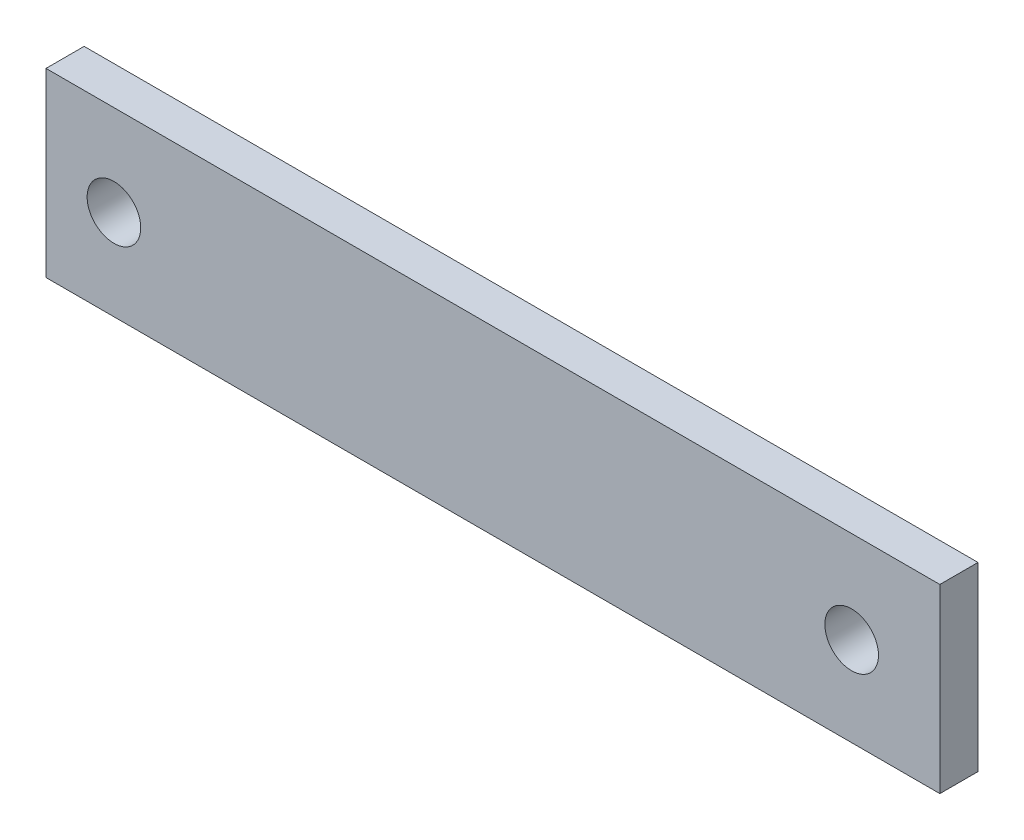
ISO-10303-21;
HEADER;
FILE_DESCRIPTION(('STEP AP214'),'2;1');
FILE_NAME('part.step','',(''),(''),'','','');
FILE_SCHEMA(('AUTOMOTIVE_DESIGN { 1 0 10303 214 1 1 1 1 }'));
ENDSEC;
DATA;
#1=APPLICATION_CONTEXT('core data for automotive mechanical design processes');
#2=APPLICATION_PROTOCOL_DEFINITION('international standard','automotive_design',2000,#1);
#3=PRODUCT_CONTEXT('',#1,'mechanical');
#4=PRODUCT('Part','Part','',(#3));
#5=PRODUCT_RELATED_PRODUCT_CATEGORY('part','',(#4));
#6=PRODUCT_DEFINITION_FORMATION('','',#4);
#7=PRODUCT_DEFINITION_CONTEXT('part definition',#1,'design');
#8=PRODUCT_DEFINITION('design','',#6,#7);
#9=PRODUCT_DEFINITION_SHAPE('','',#8);
#10=(LENGTH_UNIT() NAMED_UNIT(*) SI_UNIT(.MILLI.,.METRE.));
#11=(NAMED_UNIT(*) PLANE_ANGLE_UNIT() SI_UNIT($,.RADIAN.));
#12=(NAMED_UNIT(*) SI_UNIT($,.STERADIAN.) SOLID_ANGLE_UNIT());
#13=UNCERTAINTY_MEASURE_WITH_UNIT(LENGTH_MEASURE(1.E-05),#10,'distance_accuracy_value','');
#14=(GEOMETRIC_REPRESENTATION_CONTEXT(3) GLOBAL_UNCERTAINTY_ASSIGNED_CONTEXT((#13)) GLOBAL_UNIT_ASSIGNED_CONTEXT((#10,
#11,#12)) REPRESENTATION_CONTEXT('',''));
#15=CARTESIAN_POINT('',(0.,0.,0.));
#16=DIRECTION('',(0.,0.,1.));
#17=DIRECTION('',(1.,0.,0.));
#18=AXIS2_PLACEMENT_3D('',#15,#16,#17);
#19=CARTESIAN_POINT('',(-24.3932594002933,11.4859849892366,1.6));
#20=DIRECTION('',(0.,0.,1.));
#21=DIRECTION('',(1.,0.,0.));
#22=AXIS2_PLACEMENT_3D('',#19,#20,#21);
#23=PLANE('',#22);
#24=CARTESIAN_POINT('',(9.40674059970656,15.2245708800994,1.6));
#25=DIRECTION('',(0.,0.,1.));
#26=DIRECTION('',(1.,0.,0.));
#27=AXIS2_PLACEMENT_3D('',#24,#25,#26);
#28=CIRCLE('',#27,1.12491727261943);
#29=CARTESIAN_POINT('',(10.531657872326,15.2245708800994,1.6));
#30=VERTEX_POINT('',#29);
#31=EDGE_CURVE('E85',#30,#30,#28,.T.);
#32=ORIENTED_EDGE('',*,*,#31,.F.);
#33=EDGE_LOOP('',(#32));
#34=FACE_BOUND('',#33,.T.);
#35=DIRECTION('',(0.,-1.,0.));
#36=VECTOR('',#35,1.);
#37=CARTESIAN_POINT('',(-24.3932594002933,19.0859849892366,1.6));
#38=LINE('',#37,#36);
#39=CARTESIAN_POINT('',(-24.3932594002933,19.0859849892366,1.6));
#40=VERTEX_POINT('',#39);
#41=CARTESIAN_POINT('',(-24.3932594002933,11.4859849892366,1.6));
#42=VERTEX_POINT('',#41);
#43=EDGE_CURVE('E95',#40,#42,#38,.T.);
#44=ORIENTED_EDGE('',*,*,#43,.T.);
#45=DIRECTION('',(1.,0.,0.));
#46=VECTOR('',#45,1.);
#47=CARTESIAN_POINT('',(-24.3932594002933,11.4859849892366,1.6));
#48=LINE('',#47,#46);
#49=CARTESIAN_POINT('',(13.1067405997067,11.4859849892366,1.6));
#50=VERTEX_POINT('',#49);
#51=EDGE_CURVE('E80',#42,#50,#48,.T.);
#52=ORIENTED_EDGE('',*,*,#51,.T.);
#53=DIRECTION('',(0.,1.,0.));
#54=VECTOR('',#53,1.);
#55=CARTESIAN_POINT('',(13.1067405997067,19.0859849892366,1.6));
#56=LINE('',#55,#54);
#57=CARTESIAN_POINT('',(13.1067405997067,19.0859849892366,1.6));
#58=VERTEX_POINT('',#57);
#59=EDGE_CURVE('E46',#50,#58,#56,.T.);
#60=ORIENTED_EDGE('',*,*,#59,.T.);
#61=DIRECTION('',(-1.,0.,0.));
#62=VECTOR('',#61,1.);
#63=CARTESIAN_POINT('',(-24.3932594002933,19.0859849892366,1.6));
#64=LINE('',#63,#62);
#65=EDGE_CURVE('E41',#58,#40,#64,.T.);
#66=ORIENTED_EDGE('',*,*,#65,.T.);
#67=EDGE_LOOP('',(#44,#52,#60,#66));
#68=FACE_BOUND('',#67,.T.);
#69=CARTESIAN_POINT('',(-21.5432594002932,15.2792621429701,1.6));
#70=DIRECTION('',(0.,0.,1.));
#71=DIRECTION('',(1.,0.,0.));
#72=AXIS2_PLACEMENT_3D('',#69,#70,#71);
#73=CIRCLE('',#72,1.12491727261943);
#74=CARTESIAN_POINT('',(-20.4183421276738,15.2792621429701,1.6));
#75=VERTEX_POINT('',#74);
#76=EDGE_CURVE('E113',#75,#75,#73,.T.);
#77=ORIENTED_EDGE('',*,*,#76,.F.);
#78=EDGE_LOOP('',(#77));
#79=FACE_BOUND('',#78,.T.);
#80=ADVANCED_FACE('F26',(#34,#68,#79),#23,.T.);
#81=CARTESIAN_POINT('',(-24.3932594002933,11.4859849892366,0.));
#82=DIRECTION('',(0.,0.,1.));
#83=DIRECTION('',(1.,0.,0.));
#84=AXIS2_PLACEMENT_3D('',#81,#82,#83);
#85=PLANE('',#84);
#86=CARTESIAN_POINT('',(9.40674059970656,15.2245708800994,0.));
#87=DIRECTION('',(0.,0.,1.));
#88=DIRECTION('',(1.,0.,0.));
#89=AXIS2_PLACEMENT_3D('',#86,#87,#88);
#90=CIRCLE('',#89,1.12491727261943);
#91=CARTESIAN_POINT('',(10.531657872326,15.2245708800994,0.));
#92=VERTEX_POINT('',#91);
#93=EDGE_CURVE('E88',#92,#92,#90,.T.);
#94=ORIENTED_EDGE('',*,*,#93,.T.);
#95=EDGE_LOOP('',(#94));
#96=FACE_BOUND('',#95,.T.);
#97=DIRECTION('',(0.,-1.,0.));
#98=VECTOR('',#97,1.);
#99=CARTESIAN_POINT('',(-24.3932594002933,19.0859849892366,0.));
#100=LINE('',#99,#98);
#101=CARTESIAN_POINT('',(-24.3932594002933,19.0859849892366,0.));
#102=VERTEX_POINT('',#101);
#103=CARTESIAN_POINT('',(-24.3932594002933,11.4859849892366,0.));
#104=VERTEX_POINT('',#103);
#105=EDGE_CURVE('E72',#102,#104,#100,.T.);
#106=ORIENTED_EDGE('',*,*,#105,.F.);
#107=DIRECTION('',(-1.,0.,0.));
#108=VECTOR('',#107,1.);
#109=CARTESIAN_POINT('',(-24.3932594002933,19.0859849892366,0.));
#110=LINE('',#109,#108);
#111=CARTESIAN_POINT('',(13.1067405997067,19.0859849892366,0.));
#112=VERTEX_POINT('',#111);
#113=EDGE_CURVE('E93',#112,#102,#110,.T.);
#114=ORIENTED_EDGE('',*,*,#113,.F.);
#115=DIRECTION('',(0.,1.,0.));
#116=VECTOR('',#115,1.);
#117=CARTESIAN_POINT('',(13.1067405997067,19.0859849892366,0.));
#118=LINE('',#117,#116);
#119=CARTESIAN_POINT('',(13.1067405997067,11.4859849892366,0.));
#120=VERTEX_POINT('',#119);
#121=EDGE_CURVE('E73',#120,#112,#118,.T.);
#122=ORIENTED_EDGE('',*,*,#121,.F.);
#123=DIRECTION('',(1.,0.,0.));
#124=VECTOR('',#123,1.);
#125=CARTESIAN_POINT('',(-24.3932594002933,11.4859849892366,0.));
#126=LINE('',#125,#124);
#127=EDGE_CURVE('E67',#104,#120,#126,.T.);
#128=ORIENTED_EDGE('',*,*,#127,.F.);
#129=EDGE_LOOP('',(#106,#114,#122,#128));
#130=FACE_BOUND('',#129,.T.);
#131=CARTESIAN_POINT('',(-21.5432594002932,15.2792621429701,0.));
#132=DIRECTION('',(0.,0.,1.));
#133=DIRECTION('',(1.,0.,0.));
#134=AXIS2_PLACEMENT_3D('',#131,#132,#133);
#135=CIRCLE('',#134,1.12491727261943);
#136=CARTESIAN_POINT('',(-20.4183421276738,15.2792621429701,0.));
#137=VERTEX_POINT('',#136);
#138=EDGE_CURVE('E115',#137,#137,#135,.T.);
#139=ORIENTED_EDGE('',*,*,#138,.T.);
#140=EDGE_LOOP('',(#139));
#141=FACE_BOUND('',#140,.T.);
#142=ADVANCED_FACE('F68',(#96,#130,#141),#85,.F.);
#143=CARTESIAN_POINT('',(-24.3932594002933,19.0859849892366,1.6));
#144=DIRECTION('',(1.,0.,0.));
#145=DIRECTION('',(0.,1.,0.));
#146=AXIS2_PLACEMENT_3D('',#143,#144,#145);
#147=PLANE('',#146);
#148=ORIENTED_EDGE('',*,*,#105,.T.);
#149=DIRECTION('',(0.,0.,-1.));
#150=VECTOR('',#149,1.);
#151=CARTESIAN_POINT('',(-24.3932594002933,11.4859849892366,1.6));
#152=LINE('',#151,#150);
#153=EDGE_CURVE('E11',#42,#104,#152,.T.);
#154=ORIENTED_EDGE('',*,*,#153,.F.);
#155=ORIENTED_EDGE('',*,*,#43,.F.);
#156=DIRECTION('',(0.,0.,-1.));
#157=VECTOR('',#156,1.);
#158=CARTESIAN_POINT('',(-24.3932594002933,19.0859849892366,1.6));
#159=LINE('',#158,#157);
#160=EDGE_CURVE('E84',#40,#102,#159,.T.);
#161=ORIENTED_EDGE('',*,*,#160,.T.);
#162=EDGE_LOOP('',(#148,#154,#155,#161));
#163=FACE_BOUND('',#162,.T.);
#164=ADVANCED_FACE('F28',(#163),#147,.F.);
#165=CARTESIAN_POINT('',(-24.3932594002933,11.4859849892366,1.6));
#166=DIRECTION('',(0.,1.,0.));
#167=DIRECTION('',(0.,0.,1.));
#168=AXIS2_PLACEMENT_3D('',#165,#166,#167);
#169=PLANE('',#168);
#170=ORIENTED_EDGE('',*,*,#127,.T.);
#171=DIRECTION('',(0.,0.,-1.));
#172=VECTOR('',#171,1.);
#173=CARTESIAN_POINT('',(13.1067405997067,11.4859849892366,1.6));
#174=LINE('',#173,#172);
#175=EDGE_CURVE('E34',#50,#120,#174,.T.);
#176=ORIENTED_EDGE('',*,*,#175,.F.);
#177=ORIENTED_EDGE('',*,*,#51,.F.);
#178=ORIENTED_EDGE('',*,*,#153,.T.);
#179=EDGE_LOOP('',(#170,#176,#177,#178));
#180=FACE_BOUND('',#179,.T.);
#181=ADVANCED_FACE('F79',(#180),#169,.F.);
#182=CARTESIAN_POINT('',(13.1067405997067,19.0859849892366,1.6));
#183=DIRECTION('',(-1.,0.,0.));
#184=DIRECTION('',(0.,-1.,0.));
#185=AXIS2_PLACEMENT_3D('',#182,#183,#184);
#186=PLANE('',#185);
#187=ORIENTED_EDGE('',*,*,#121,.T.);
#188=DIRECTION('',(0.,0.,-1.));
#189=VECTOR('',#188,1.);
#190=CARTESIAN_POINT('',(13.1067405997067,19.0859849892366,1.6));
#191=LINE('',#190,#189);
#192=EDGE_CURVE('E101',#58,#112,#191,.T.);
#193=ORIENTED_EDGE('',*,*,#192,.F.);
#194=ORIENTED_EDGE('',*,*,#59,.F.);
#195=ORIENTED_EDGE('',*,*,#175,.T.);
#196=EDGE_LOOP('',(#187,#193,#194,#195));
#197=FACE_BOUND('',#196,.T.);
#198=ADVANCED_FACE('F104',(#197),#186,.F.);
#199=CARTESIAN_POINT('',(-24.3932594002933,19.0859849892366,1.6));
#200=DIRECTION('',(0.,-1.,0.));
#201=DIRECTION('',(0.,0.,-1.));
#202=AXIS2_PLACEMENT_3D('',#199,#200,#201);
#203=PLANE('',#202);
#204=ORIENTED_EDGE('',*,*,#113,.T.);
#205=ORIENTED_EDGE('',*,*,#160,.F.);
#206=ORIENTED_EDGE('',*,*,#65,.F.);
#207=ORIENTED_EDGE('',*,*,#192,.T.);
#208=EDGE_LOOP('',(#204,#205,#206,#207));
#209=FACE_BOUND('',#208,.T.);
#210=ADVANCED_FACE('F106',(#209),#203,.F.);
#211=CARTESIAN_POINT('',(9.40674059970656,15.2245708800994,1.6));
#212=DIRECTION('',(0.,0.,-1.));
#213=DIRECTION('',(-1.,0.,0.));
#214=AXIS2_PLACEMENT_3D('',#211,#212,#213);
#215=CYLINDRICAL_SURFACE('',#214,1.12491727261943);
#216=ORIENTED_EDGE('',*,*,#31,.T.);
#217=EDGE_LOOP('',(#216));
#218=FACE_BOUND('',#217,.T.);
#219=ORIENTED_EDGE('',*,*,#93,.F.);
#220=EDGE_LOOP('',(#219));
#221=FACE_BOUND('',#220,.T.);
#222=ADVANCED_FACE('F124',(#218,#221),#215,.F.);
#223=CARTESIAN_POINT('',(-21.5432594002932,15.2792621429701,1.6));
#224=DIRECTION('',(0.,0.,-1.));
#225=DIRECTION('',(-1.,0.,0.));
#226=AXIS2_PLACEMENT_3D('',#223,#224,#225);
#227=CYLINDRICAL_SURFACE('',#226,1.12491727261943);
#228=ORIENTED_EDGE('',*,*,#76,.T.);
#229=EDGE_LOOP('',(#228));
#230=FACE_BOUND('',#229,.T.);
#231=ORIENTED_EDGE('',*,*,#138,.F.);
#232=EDGE_LOOP('',(#231));
#233=FACE_BOUND('',#232,.T.);
#234=ADVANCED_FACE('F122',(#230,#233),#227,.F.);
#235=CLOSED_SHELL('',(#80,#142,#164,#181,#198,#210,#222,#234));
#236=MANIFOLD_SOLID_BREP('B2',#235);
#237=ADVANCED_BREP_SHAPE_REPRESENTATION('',(#18,#236),#14);
#238=SHAPE_DEFINITION_REPRESENTATION(#9,#237);
ENDSEC;
END-ISO-10303-21;
